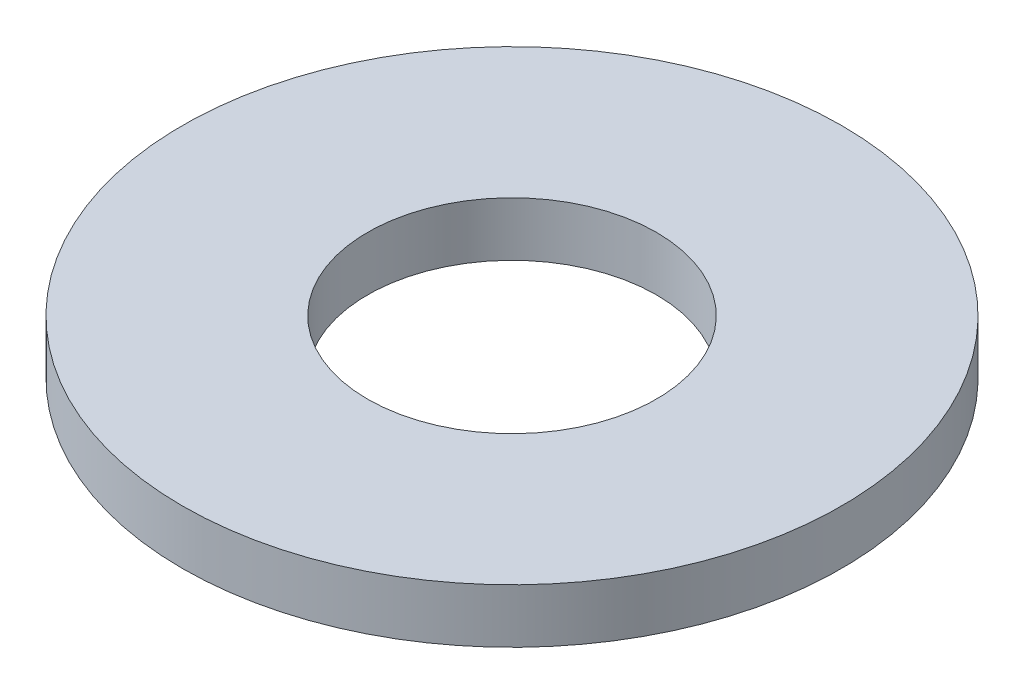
from build123d import *

# Parameters (mm, degrees)
SKETCH1_R           = 3.65
SKETCH1_R_2         = 1.6
BOSS_EXTRUDE1_DEPTH = 0.6


with BuildPart() as part:
    # Sketch1 → Boss-Extrude1 (new body)
    with BuildSketch(Plane(origin=(0, 0, 0), x_dir=(1, 0, 0), z_dir=(0, 1, 0))):
        with Locations(Location((0, 0, 0), (0, 0, 270))):
            Circle(SKETCH1_R)
        with Locations(Location((0, 0, 0), (0, 0, 270))):
            Circle(SKETCH1_R_2, mode=Mode.SUBTRACT)
    extrude(amount=BOSS_EXTRUDE1_DEPTH)


solid = part.part
